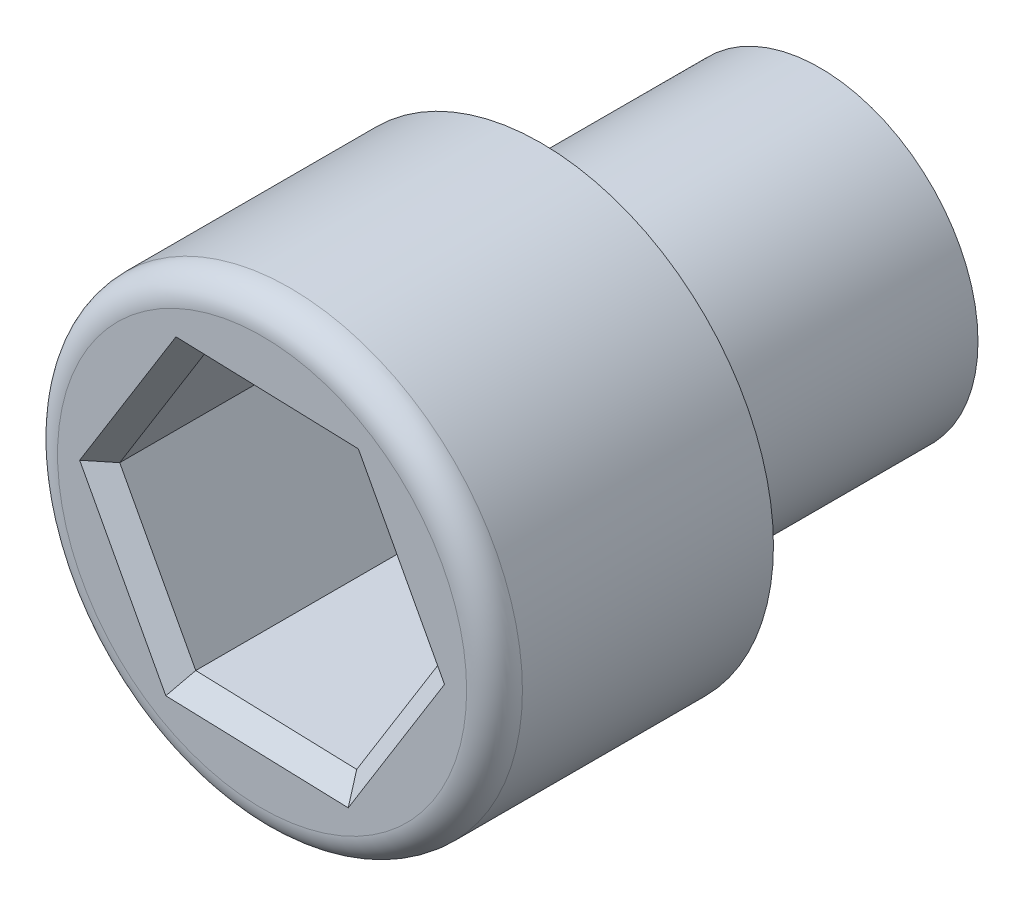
ISO-10303-21;
HEADER;
FILE_DESCRIPTION(('STEP AP214'),'2;1');
FILE_NAME('part.step','',(''),(''),'','','');
FILE_SCHEMA(('AUTOMOTIVE_DESIGN { 1 0 10303 214 1 1 1 1 }'));
ENDSEC;
DATA;
#1=APPLICATION_CONTEXT('core data for automotive mechanical design processes');
#2=APPLICATION_PROTOCOL_DEFINITION('international standard','automotive_design',2000,#1);
#3=PRODUCT_CONTEXT('',#1,'mechanical');
#4=PRODUCT('Part','Part','',(#3));
#5=PRODUCT_RELATED_PRODUCT_CATEGORY('part','',(#4));
#6=PRODUCT_DEFINITION_FORMATION('','',#4);
#7=PRODUCT_DEFINITION_CONTEXT('part definition',#1,'design');
#8=PRODUCT_DEFINITION('design','',#6,#7);
#9=PRODUCT_DEFINITION_SHAPE('','',#8);
#10=(LENGTH_UNIT() NAMED_UNIT(*) SI_UNIT(.MILLI.,.METRE.));
#11=(NAMED_UNIT(*) PLANE_ANGLE_UNIT() SI_UNIT($,.RADIAN.));
#12=(NAMED_UNIT(*) SI_UNIT($,.STERADIAN.) SOLID_ANGLE_UNIT());
#13=UNCERTAINTY_MEASURE_WITH_UNIT(LENGTH_MEASURE(1.E-05),#10,'distance_accuracy_value','');
#14=(GEOMETRIC_REPRESENTATION_CONTEXT(3) GLOBAL_UNCERTAINTY_ASSIGNED_CONTEXT((#13)) GLOBAL_UNIT_ASSIGNED_CONTEXT((#10,
#11,#12)) REPRESENTATION_CONTEXT('',''));
#15=CARTESIAN_POINT('',(0.,0.,0.));
#16=DIRECTION('',(0.,0.,1.));
#17=DIRECTION('',(1.,0.,0.));
#18=AXIS2_PLACEMENT_3D('',#15,#16,#17);
#19=CARTESIAN_POINT('',(0.,0.,3.));
#20=DIRECTION('',(0.,0.,-1.));
#21=DIRECTION('',(-1.,0.,0.));
#22=AXIS2_PLACEMENT_3D('',#19,#20,#21);
#23=CYLINDRICAL_SURFACE('',#22,1.7);
#24=CARTESIAN_POINT('',(0.,0.,3.));
#25=DIRECTION('',(0.,0.,1.));
#26=DIRECTION('',(1.,0.,0.));
#27=AXIS2_PLACEMENT_3D('',#24,#25,#26);
#28=CIRCLE('',#27,1.7);
#29=CARTESIAN_POINT('',(1.69999798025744,0.00262051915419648,3.));
#30=VERTEX_POINT('',#29);
#31=CARTESIAN_POINT('',(0.944881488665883,1.41322290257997,3.));
#32=VERTEX_POINT('',#31);
#33=EDGE_CURVE('E265',#30,#32,#28,.T.);
#34=ORIENTED_EDGE('',*,*,#33,.F.);
#35=CARTESIAN_POINT('',(1.69632767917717,-0.111679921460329,3.));
#36=VERTEX_POINT('',#35);
#37=EDGE_CURVE('E270',#36,#30,#28,.T.);
#38=ORIENTED_EDGE('',*,*,#37,.F.);
#39=CARTESIAN_POINT('',(0.852268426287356,-1.47093117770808,3.));
#40=VERTEX_POINT('',#39);
#41=EDGE_CURVE('E364',#40,#36,#28,.T.);
#42=ORIENTED_EDGE('',*,*,#41,.F.);
#43=CARTESIAN_POINT('',(0.75144619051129,-1.5249028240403,3.));
#44=VERTEX_POINT('',#43);
#45=EDGE_CURVE('E362',#44,#40,#28,.T.);
#46=ORIENTED_EDGE('',*,*,#45,.F.);
#47=CARTESIAN_POINT('',(-0.84772955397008,-1.47355169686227,3.));
#48=VERTEX_POINT('',#47);
#49=EDGE_CURVE('E355',#48,#44,#28,.T.);
#50=ORIENTED_EDGE('',*,*,#49,.F.);
#51=CARTESIAN_POINT('',(-0.944881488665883,-1.41322290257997,3.));
#52=VERTEX_POINT('',#51);
#53=EDGE_CURVE('E360',#52,#48,#28,.T.);
#54=ORIENTED_EDGE('',*,*,#53,.F.);
#55=CARTESIAN_POINT('',(-1.69999798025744,-0.00262051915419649,3.));
#56=VERTEX_POINT('',#55);
#57=EDGE_CURVE('E363',#56,#52,#28,.T.);
#58=ORIENTED_EDGE('',*,*,#57,.F.);
#59=CARTESIAN_POINT('',(-1.69632767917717,0.111679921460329,3.));
#60=VERTEX_POINT('',#59);
#61=EDGE_CURVE('E375',#60,#56,#28,.T.);
#62=ORIENTED_EDGE('',*,*,#61,.F.);
#63=CARTESIAN_POINT('',(-0.852268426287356,1.47093117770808,3.));
#64=VERTEX_POINT('',#63);
#65=EDGE_CURVE('E374',#64,#60,#28,.T.);
#66=ORIENTED_EDGE('',*,*,#65,.F.);
#67=CARTESIAN_POINT('',(-0.75144619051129,1.5249028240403,3.));
#68=VERTEX_POINT('',#67);
#69=EDGE_CURVE('E373',#68,#64,#28,.T.);
#70=ORIENTED_EDGE('',*,*,#69,.F.);
#71=CARTESIAN_POINT('',(0.84772955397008,1.47355169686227,3.));
#72=VERTEX_POINT('',#71);
#73=EDGE_CURVE('E172',#72,#68,#28,.T.);
#74=ORIENTED_EDGE('',*,*,#73,.F.);
#75=EDGE_CURVE('E269',#32,#72,#28,.T.);
#76=ORIENTED_EDGE('',*,*,#75,.F.);
#77=EDGE_LOOP('',(#34,#38,#42,#46,#50,#54,#58,#62,#66,#70,#74,#76));
#78=FACE_BOUND('',#77,.T.);
#79=CARTESIAN_POINT('',(0.,0.,0.));
#80=DIRECTION('',(0.,0.,1.));
#81=DIRECTION('',(1.,0.,0.));
#82=AXIS2_PLACEMENT_3D('',#79,#80,#81);
#83=CIRCLE('',#82,1.7);
#84=CARTESIAN_POINT('',(1.7,0.,0.));
#85=VERTEX_POINT('',#84);
#86=EDGE_CURVE('E264',#85,#85,#83,.T.);
#87=ORIENTED_EDGE('',*,*,#86,.T.);
#88=EDGE_LOOP('',(#87));
#89=FACE_BOUND('',#88,.T.);
#90=ADVANCED_FACE('F33',(#78,#89),#23,.T.);
#91=CARTESIAN_POINT('',(0.,0.,0.));
#92=DIRECTION('',(0.,0.,1.));
#93=DIRECTION('',(1.,0.,0.));
#94=AXIS2_PLACEMENT_3D('',#91,#92,#93);
#95=PLANE('',#94);
#96=ORIENTED_EDGE('',*,*,#86,.F.);
#97=EDGE_LOOP('',(#96));
#98=FACE_BOUND('',#97,.T.);
#99=ADVANCED_FACE('F297',(#98),#95,.F.);
#100=CARTESIAN_POINT('',(0.,0.,6.));
#101=DIRECTION('',(0.,0.,-1.));
#102=DIRECTION('',(-1.,0.,0.));
#103=AXIS2_PLACEMENT_3D('',#100,#101,#102);
#104=CYLINDRICAL_SURFACE('',#103,2.5);
#105=CARTESIAN_POINT('',(0.,0.,5.7));
#106=DIRECTION('',(0.,0.,1.));
#107=DIRECTION('',(1.,0.,0.));
#108=AXIS2_PLACEMENT_3D('',#105,#106,#107);
#109=CIRCLE('',#108,2.5);
#110=CARTESIAN_POINT('',(2.5,0.,5.7));
#111=VERTEX_POINT('',#110);
#112=EDGE_CURVE('E180',#111,#111,#109,.F.);
#113=ORIENTED_EDGE('',*,*,#112,.T.);
#114=EDGE_LOOP('',(#113));
#115=FACE_BOUND('',#114,.T.);
#116=CARTESIAN_POINT('',(0.,0.,3.));
#117=DIRECTION('',(0.,0.,1.));
#118=DIRECTION('',(1.,0.,0.));
#119=AXIS2_PLACEMENT_3D('',#116,#117,#118);
#120=CIRCLE('',#119,2.5);
#121=CARTESIAN_POINT('',(2.5,0.,3.));
#122=VERTEX_POINT('',#121);
#123=EDGE_CURVE('E252',#122,#122,#120,.T.);
#124=ORIENTED_EDGE('',*,*,#123,.T.);
#125=EDGE_LOOP('',(#124));
#126=FACE_BOUND('',#125,.T.);
#127=ADVANCED_FACE('F278',(#115,#126),#104,.T.);
#128=CARTESIAN_POINT('',(0.,0.,6.));
#129=DIRECTION('',(0.,0.,1.));
#130=DIRECTION('',(1.,0.,0.));
#131=AXIS2_PLACEMENT_3D('',#128,#129,#130);
#132=PLANE('',#131);
#133=DIRECTION('',(-0.527537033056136,-0.849532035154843,0.));
#134=VECTOR('',#133,1.);
#135=CARTESIAN_POINT('',(0.987343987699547,-1.63252927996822,6.));
#136=LINE('',#135,#134);
#137=CARTESIAN_POINT('',(1.96197966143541,-0.0630011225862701,6.));
#138=VERTEX_POINT('',#137);
#139=CARTESIAN_POINT('',(0.926429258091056,-1.73062478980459,6.));
#140=VERTEX_POINT('',#139);
#141=EDGE_CURVE('E193',#138,#140,#136,.T.);
#142=ORIENTED_EDGE('',*,*,#141,.T.);
#143=DIRECTION('',(-0.999484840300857,0.0320944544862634,0.));
#144=VECTOR('',#143,1.);
#145=CARTESIAN_POINT('',(-0.920139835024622,-1.67132961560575,6.));
#146=LINE('',#145,#144);
#147=CARTESIAN_POINT('',(-1.03555040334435,-1.66762366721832,6.));
#148=VERTEX_POINT('',#147);
#149=EDGE_CURVE('E203',#140,#148,#146,.T.);
#150=ORIENTED_EDGE('',*,*,#149,.T.);
#151=DIRECTION('',(-0.471947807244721,0.881626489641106,0.));
#152=VECTOR('',#151,1.);
#153=CARTESIAN_POINT('',(-1.90748382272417,-0.0388003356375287,6.));
#154=LINE('',#153,#152);
#155=CARTESIAN_POINT('',(-1.96197966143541,0.0630011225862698,6.));
#156=VERTEX_POINT('',#155);
#157=EDGE_CURVE('E201',#148,#156,#154,.T.);
#158=ORIENTED_EDGE('',*,*,#157,.T.);
#159=DIRECTION('',(0.527537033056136,0.849532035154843,0.));
#160=VECTOR('',#159,1.);
#161=CARTESIAN_POINT('',(-0.987343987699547,1.63252927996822,6.));
#162=LINE('',#161,#160);
#163=CARTESIAN_POINT('',(-0.926429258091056,1.73062478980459,6.));
#164=VERTEX_POINT('',#163);
#165=EDGE_CURVE('E199',#156,#164,#162,.T.);
#166=ORIENTED_EDGE('',*,*,#165,.T.);
#167=DIRECTION('',(0.999484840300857,-0.0320944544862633,0.));
#168=VECTOR('',#167,1.);
#169=CARTESIAN_POINT('',(0.920139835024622,1.67132961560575,6.));
#170=LINE('',#169,#168);
#171=CARTESIAN_POINT('',(1.03555040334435,1.66762366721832,6.));
#172=VERTEX_POINT('',#171);
#173=EDGE_CURVE('E197',#164,#172,#170,.T.);
#174=ORIENTED_EDGE('',*,*,#173,.T.);
#175=DIRECTION('',(0.471947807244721,-0.881626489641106,0.));
#176=VECTOR('',#175,1.);
#177=CARTESIAN_POINT('',(1.90748382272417,0.0388003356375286,6.));
#178=LINE('',#177,#176);
#179=EDGE_CURVE('E195',#172,#138,#178,.T.);
#180=ORIENTED_EDGE('',*,*,#179,.T.);
#181=EDGE_LOOP('',(#142,#150,#158,#166,#174,#180));
#182=FACE_BOUND('',#181,.T.);
#183=CARTESIAN_POINT('',(0.,0.,6.));
#184=DIRECTION('',(0.,0.,1.));
#185=DIRECTION('',(1.,0.,0.));
#186=AXIS2_PLACEMENT_3D('',#183,#184,#185);
#187=CIRCLE('',#186,2.2);
#188=CARTESIAN_POINT('',(2.2,0.,6.));
#189=VERTEX_POINT('',#188);
#190=EDGE_CURVE('E268',#189,#189,#187,.T.);
#191=ORIENTED_EDGE('',*,*,#190,.T.);
#192=EDGE_LOOP('',(#191));
#193=FACE_BOUND('',#192,.T.);
#194=ADVANCED_FACE('F288',(#182,#193),#132,.T.);
#195=CARTESIAN_POINT('',(0.,0.,3.));
#196=DIRECTION('',(0.,0.,1.));
#197=DIRECTION('',(1.,0.,0.));
#198=AXIS2_PLACEMENT_3D('',#195,#196,#197);
#199=PLANE('',#198);
#200=DIRECTION('',(-0.471947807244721,0.881626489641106,0.));
#201=VECTOR('',#200,1.);
#202=CARTESIAN_POINT('',(1.32243973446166,0.707921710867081,3.));
#203=LINE('',#202,#201);
#204=CARTESIAN_POINT('',(0.91372094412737,1.47143264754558,3.));
#205=VERTEX_POINT('',#204);
#206=EDGE_CURVE('E188',#32,#205,#203,.T.);
#207=ORIENTED_EDGE('',*,*,#206,.T.);
#208=DIRECTION('',(-0.999484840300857,0.0320944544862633,0.));
#209=VECTOR('',#208,1.);
#210=CARTESIAN_POINT('',(0.91372094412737,1.47143264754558,3.));
#211=LINE('',#210,#209);
#212=EDGE_CURVE('E231',#205,#72,#211,.T.);
#213=ORIENTED_EDGE('',*,*,#212,.T.);
#214=ORIENTED_EDGE('',*,*,#73,.T.);
#215=DIRECTION('',(-0.999484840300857,0.0320944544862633,0.));
#216=VECTOR('',#215,1.);
#217=CARTESIAN_POINT('',(0.048141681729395,1.49922726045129,3.));
#218=LINE('',#217,#216);
#219=CARTESIAN_POINT('',(-0.81743758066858,1.52702187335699,3.));
#220=VERTEX_POINT('',#219);
#221=EDGE_CURVE('E146',#68,#220,#218,.T.);
#222=ORIENTED_EDGE('',*,*,#221,.T.);
#223=DIRECTION('',(-0.527537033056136,-0.849532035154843,0.));
#224=VECTOR('',#223,1.);
#225=CARTESIAN_POINT('',(-0.81743758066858,1.52702187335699,3.));
#226=LINE('',#225,#224);
#227=EDGE_CURVE('E156',#220,#64,#226,.T.);
#228=ORIENTED_EDGE('',*,*,#227,.T.);
#229=ORIENTED_EDGE('',*,*,#65,.T.);
#230=DIRECTION('',(-0.527537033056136,-0.849532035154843,0.));
#231=VECTOR('',#230,1.);
#232=CARTESIAN_POINT('',(-1.27429805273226,0.791305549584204,3.));
#233=LINE('',#232,#231);
#234=CARTESIAN_POINT('',(-1.73115852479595,0.0555892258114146,3.));
#235=VERTEX_POINT('',#234);
#236=EDGE_CURVE('E174',#60,#235,#233,.T.);
#237=ORIENTED_EDGE('',*,*,#236,.T.);
#238=DIRECTION('',(0.471947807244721,-0.881626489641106,0.));
#239=VECTOR('',#238,1.);
#240=CARTESIAN_POINT('',(-1.73115852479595,0.0555892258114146,3.));
#241=LINE('',#240,#239);
#242=EDGE_CURVE('E236',#235,#56,#241,.T.);
#243=ORIENTED_EDGE('',*,*,#242,.T.);
#244=ORIENTED_EDGE('',*,*,#57,.T.);
#245=DIRECTION('',(0.471947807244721,-0.881626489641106,0.));
#246=VECTOR('',#245,1.);
#247=CARTESIAN_POINT('',(-1.32243973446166,-0.707921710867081,3.));
#248=LINE('',#247,#246);
#249=CARTESIAN_POINT('',(-0.913720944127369,-1.47143264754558,3.));
#250=VERTEX_POINT('',#249);
#251=EDGE_CURVE('E173',#52,#250,#248,.T.);
#252=ORIENTED_EDGE('',*,*,#251,.T.);
#253=DIRECTION('',(0.999484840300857,-0.0320944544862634,0.));
#254=VECTOR('',#253,1.);
#255=CARTESIAN_POINT('',(-0.913720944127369,-1.47143264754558,3.));
#256=LINE('',#255,#254);
#257=EDGE_CURVE('E240',#250,#48,#256,.T.);
#258=ORIENTED_EDGE('',*,*,#257,.T.);
#259=ORIENTED_EDGE('',*,*,#49,.T.);
#260=DIRECTION('',(0.999484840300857,-0.0320944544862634,0.));
#261=VECTOR('',#260,1.);
#262=CARTESIAN_POINT('',(-0.0481416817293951,-1.49922726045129,3.));
#263=LINE('',#262,#261);
#264=CARTESIAN_POINT('',(0.81743758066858,-1.52702187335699,3.));
#265=VERTEX_POINT('',#264);
#266=EDGE_CURVE('E177',#44,#265,#263,.T.);
#267=ORIENTED_EDGE('',*,*,#266,.T.);
#268=DIRECTION('',(0.527537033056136,0.849532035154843,0.));
#269=VECTOR('',#268,1.);
#270=CARTESIAN_POINT('',(0.81743758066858,-1.52702187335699,3.));
#271=LINE('',#270,#269);
#272=EDGE_CURVE('E244',#265,#40,#271,.T.);
#273=ORIENTED_EDGE('',*,*,#272,.T.);
#274=ORIENTED_EDGE('',*,*,#41,.T.);
#275=DIRECTION('',(0.527537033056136,0.849532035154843,0.));
#276=VECTOR('',#275,1.);
#277=CARTESIAN_POINT('',(1.27429805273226,-0.791305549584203,3.));
#278=LINE('',#277,#276);
#279=CARTESIAN_POINT('',(1.73115852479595,-0.0555892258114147,3.));
#280=VERTEX_POINT('',#279);
#281=EDGE_CURVE('E185',#36,#280,#278,.T.);
#282=ORIENTED_EDGE('',*,*,#281,.T.);
#283=DIRECTION('',(-0.471947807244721,0.881626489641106,0.));
#284=VECTOR('',#283,1.);
#285=CARTESIAN_POINT('',(1.73115852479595,-0.0555892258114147,3.));
#286=LINE('',#285,#284);
#287=EDGE_CURVE('E153',#280,#30,#286,.T.);
#288=ORIENTED_EDGE('',*,*,#287,.T.);
#289=ORIENTED_EDGE('',*,*,#33,.T.);
#290=EDGE_LOOP('',(#207,#213,#214,#222,#228,#229,#237,#243,#244,#252,#258,#259,#267,#273,#274,
#282,#288,#289));
#291=FACE_BOUND('',#290,.T.);
#292=ORIENTED_EDGE('',*,*,#123,.F.);
#293=EDGE_LOOP('',(#292));
#294=FACE_BOUND('',#293,.T.);
#295=ADVANCED_FACE('F168',(#291,#294),#199,.F.);
#296=CARTESIAN_POINT('',(0.,0.,5.7));
#297=DIRECTION('',(0.,0.,1.));
#298=DIRECTION('',(1.,0.,0.));
#299=AXIS2_PLACEMENT_3D('',#296,#297,#298);
#300=TOROIDAL_SURFACE('',#299,2.2,0.3);
#301=ORIENTED_EDGE('',*,*,#112,.F.);
#302=EDGE_LOOP('',(#301));
#303=FACE_BOUND('',#302,.T.);
#304=ORIENTED_EDGE('',*,*,#190,.F.);
#305=EDGE_LOOP('',(#304));
#306=FACE_BOUND('',#305,.T.);
#307=ADVANCED_FACE('F281',(#303,#306),#300,.T.);
#308=CARTESIAN_POINT('',(0.,0.,3.));
#309=DIRECTION('',(0.,0.,1.));
#310=DIRECTION('',(1.,0.,0.));
#311=AXIS2_PLACEMENT_3D('',#308,#309,#310);
#312=PLANE('',#311);
#313=ORIENTED_EDGE('',*,*,#75,.T.);
#314=EDGE_CURVE('E227',#72,#68,#211,.T.);
#315=ORIENTED_EDGE('',*,*,#314,.T.);
#316=ORIENTED_EDGE('',*,*,#69,.T.);
#317=EDGE_CURVE('E159',#64,#60,#226,.T.);
#318=ORIENTED_EDGE('',*,*,#317,.T.);
#319=ORIENTED_EDGE('',*,*,#61,.T.);
#320=EDGE_CURVE('E164',#56,#52,#241,.T.);
#321=ORIENTED_EDGE('',*,*,#320,.T.);
#322=ORIENTED_EDGE('',*,*,#53,.T.);
#323=EDGE_CURVE('E239',#48,#44,#256,.T.);
#324=ORIENTED_EDGE('',*,*,#323,.T.);
#325=ORIENTED_EDGE('',*,*,#45,.T.);
#326=EDGE_CURVE('E243',#40,#36,#271,.T.);
#327=ORIENTED_EDGE('',*,*,#326,.T.);
#328=ORIENTED_EDGE('',*,*,#37,.T.);
#329=EDGE_CURVE('E247',#30,#32,#286,.T.);
#330=ORIENTED_EDGE('',*,*,#329,.T.);
#331=EDGE_LOOP('',(#313,#315,#316,#318,#319,#321,#322,#324,#325,#327,#328,#330));
#332=FACE_BOUND('',#331,.T.);
#333=ADVANCED_FACE('F284',(#332),#312,.T.);
#334=CARTESIAN_POINT('',(0.91372094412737,1.47143264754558,3.));
#335=DIRECTION('',(0.0320944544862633,0.999484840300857,0.));
#336=DIRECTION('',(-0.999484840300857,0.0320944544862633,0.));
#337=AXIS2_PLACEMENT_3D('',#334,#335,#336);
#338=PLANE('',#337);
#339=DIRECTION('',(0.,0.,1.));
#340=VECTOR('',#339,1.);
#341=CARTESIAN_POINT('',(0.91372094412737,1.47143264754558,3.));
#342=LINE('',#341,#340);
#343=CARTESIAN_POINT('',(0.91372094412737,1.47143264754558,5.8));
#344=VERTEX_POINT('',#343);
#345=EDGE_CURVE('E250',#205,#344,#342,.T.);
#346=ORIENTED_EDGE('',*,*,#345,.T.);
#347=DIRECTION('',(-0.999484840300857,0.0320944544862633,0.));
#348=VECTOR('',#347,1.);
#349=CARTESIAN_POINT('',(-0.81743758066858,1.52702187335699,5.8));
#350=LINE('',#349,#348);
#351=CARTESIAN_POINT('',(-0.81743758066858,1.52702187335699,5.8));
#352=VERTEX_POINT('',#351);
#353=EDGE_CURVE('E149',#344,#352,#350,.T.);
#354=ORIENTED_EDGE('',*,*,#353,.T.);
#355=DIRECTION('',(0.,0.,1.));
#356=VECTOR('',#355,1.);
#357=CARTESIAN_POINT('',(-0.81743758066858,1.52702187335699,3.));
#358=LINE('',#357,#356);
#359=EDGE_CURVE('E141',#220,#352,#358,.T.);
#360=ORIENTED_EDGE('',*,*,#359,.F.);
#361=ORIENTED_EDGE('',*,*,#221,.F.);
#362=ORIENTED_EDGE('',*,*,#314,.F.);
#363=ORIENTED_EDGE('',*,*,#212,.F.);
#364=EDGE_LOOP('',(#346,#354,#360,#361,#362,#363));
#365=FACE_BOUND('',#364,.T.);
#366=ADVANCED_FACE('F143',(#365),#338,.F.);
#367=CARTESIAN_POINT('',(1.73115852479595,-0.0555892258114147,3.));
#368=DIRECTION('',(0.881626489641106,0.471947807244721,0.));
#369=DIRECTION('',(-0.471947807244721,0.881626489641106,0.));
#370=AXIS2_PLACEMENT_3D('',#367,#368,#369);
#371=PLANE('',#370);
#372=DIRECTION('',(0.,0.,1.));
#373=VECTOR('',#372,1.);
#374=CARTESIAN_POINT('',(1.73115852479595,-0.0555892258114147,3.));
#375=LINE('',#374,#373);
#376=CARTESIAN_POINT('',(1.73115852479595,-0.0555892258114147,5.8));
#377=VERTEX_POINT('',#376);
#378=EDGE_CURVE('E253',#280,#377,#375,.T.);
#379=ORIENTED_EDGE('',*,*,#378,.T.);
#380=DIRECTION('',(-0.471947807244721,0.881626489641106,0.));
#381=VECTOR('',#380,1.);
#382=CARTESIAN_POINT('',(0.91372094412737,1.47143264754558,5.8));
#383=LINE('',#382,#381);
#384=EDGE_CURVE('E42',#377,#344,#383,.T.);
#385=ORIENTED_EDGE('',*,*,#384,.T.);
#386=ORIENTED_EDGE('',*,*,#345,.F.);
#387=ORIENTED_EDGE('',*,*,#206,.F.);
#388=ORIENTED_EDGE('',*,*,#329,.F.);
#389=ORIENTED_EDGE('',*,*,#287,.F.);
#390=EDGE_LOOP('',(#379,#385,#386,#387,#388,#389));
#391=FACE_BOUND('',#390,.T.);
#392=ADVANCED_FACE('F372',(#391),#371,.F.);
#393=CARTESIAN_POINT('',(0.81743758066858,-1.52702187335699,3.));
#394=DIRECTION('',(0.849532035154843,-0.527537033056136,0.));
#395=DIRECTION('',(0.527537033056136,0.849532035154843,0.));
#396=AXIS2_PLACEMENT_3D('',#393,#394,#395);
#397=PLANE('',#396);
#398=DIRECTION('',(0.,0.,1.));
#399=VECTOR('',#398,1.);
#400=CARTESIAN_POINT('',(0.81743758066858,-1.52702187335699,3.));
#401=LINE('',#400,#399);
#402=CARTESIAN_POINT('',(0.81743758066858,-1.52702187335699,5.8));
#403=VERTEX_POINT('',#402);
#404=EDGE_CURVE('E255',#265,#403,#401,.T.);
#405=ORIENTED_EDGE('',*,*,#404,.T.);
#406=DIRECTION('',(0.527537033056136,0.849532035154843,0.));
#407=VECTOR('',#406,1.);
#408=CARTESIAN_POINT('',(1.73115852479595,-0.0555892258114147,5.8));
#409=LINE('',#408,#407);
#410=EDGE_CURVE('E11',#403,#377,#409,.T.);
#411=ORIENTED_EDGE('',*,*,#410,.T.);
#412=ORIENTED_EDGE('',*,*,#378,.F.);
#413=ORIENTED_EDGE('',*,*,#281,.F.);
#414=ORIENTED_EDGE('',*,*,#326,.F.);
#415=ORIENTED_EDGE('',*,*,#272,.F.);
#416=EDGE_LOOP('',(#405,#411,#412,#413,#414,#415));
#417=FACE_BOUND('',#416,.T.);
#418=ADVANCED_FACE('F379',(#417),#397,.F.);
#419=CARTESIAN_POINT('',(-0.913720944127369,-1.47143264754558,3.));
#420=DIRECTION('',(-0.0320944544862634,-0.999484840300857,0.));
#421=DIRECTION('',(0.999484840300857,-0.0320944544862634,0.));
#422=AXIS2_PLACEMENT_3D('',#419,#420,#421);
#423=PLANE('',#422);
#424=DIRECTION('',(0.,0.,1.));
#425=VECTOR('',#424,1.);
#426=CARTESIAN_POINT('',(-0.913720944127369,-1.47143264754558,3.));
#427=LINE('',#426,#425);
#428=CARTESIAN_POINT('',(-0.913720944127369,-1.47143264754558,5.8));
#429=VERTEX_POINT('',#428);
#430=EDGE_CURVE('E257',#250,#429,#427,.T.);
#431=ORIENTED_EDGE('',*,*,#430,.T.);
#432=DIRECTION('',(0.999484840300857,-0.0320944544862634,0.));
#433=VECTOR('',#432,1.);
#434=CARTESIAN_POINT('',(0.81743758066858,-1.52702187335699,5.8));
#435=LINE('',#434,#433);
#436=EDGE_CURVE('E190',#429,#403,#435,.T.);
#437=ORIENTED_EDGE('',*,*,#436,.T.);
#438=ORIENTED_EDGE('',*,*,#404,.F.);
#439=ORIENTED_EDGE('',*,*,#266,.F.);
#440=ORIENTED_EDGE('',*,*,#323,.F.);
#441=ORIENTED_EDGE('',*,*,#257,.F.);
#442=EDGE_LOOP('',(#431,#437,#438,#439,#440,#441));
#443=FACE_BOUND('',#442,.T.);
#444=ADVANCED_FACE('F349',(#443),#423,.F.);
#445=CARTESIAN_POINT('',(-1.73115852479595,0.0555892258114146,3.));
#446=DIRECTION('',(-0.881626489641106,-0.471947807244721,0.));
#447=DIRECTION('',(0.471947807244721,-0.881626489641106,0.));
#448=AXIS2_PLACEMENT_3D('',#445,#446,#447);
#449=PLANE('',#448);
#450=DIRECTION('',(0.,0.,1.));
#451=VECTOR('',#450,1.);
#452=CARTESIAN_POINT('',(-1.73115852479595,0.0555892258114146,3.));
#453=LINE('',#452,#451);
#454=CARTESIAN_POINT('',(-1.73115852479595,0.0555892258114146,5.8));
#455=VERTEX_POINT('',#454);
#456=EDGE_CURVE('E152',#235,#455,#453,.T.);
#457=ORIENTED_EDGE('',*,*,#456,.T.);
#458=DIRECTION('',(0.471947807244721,-0.881626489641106,0.));
#459=VECTOR('',#458,1.);
#460=CARTESIAN_POINT('',(-0.913720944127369,-1.47143264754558,5.8));
#461=LINE('',#460,#459);
#462=EDGE_CURVE('E206',#455,#429,#461,.T.);
#463=ORIENTED_EDGE('',*,*,#462,.T.);
#464=ORIENTED_EDGE('',*,*,#430,.F.);
#465=ORIENTED_EDGE('',*,*,#251,.F.);
#466=ORIENTED_EDGE('',*,*,#320,.F.);
#467=ORIENTED_EDGE('',*,*,#242,.F.);
#468=EDGE_LOOP('',(#457,#463,#464,#465,#466,#467));
#469=FACE_BOUND('',#468,.T.);
#470=ADVANCED_FACE('F334',(#469),#449,.F.);
#471=CARTESIAN_POINT('',(-0.81743758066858,1.52702187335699,3.));
#472=DIRECTION('',(-0.849532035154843,0.527537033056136,0.));
#473=DIRECTION('',(-0.527537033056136,-0.849532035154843,0.));
#474=AXIS2_PLACEMENT_3D('',#471,#472,#473);
#475=PLANE('',#474);
#476=ORIENTED_EDGE('',*,*,#359,.T.);
#477=DIRECTION('',(-0.527537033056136,-0.849532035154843,0.));
#478=VECTOR('',#477,1.);
#479=CARTESIAN_POINT('',(-1.73115852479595,0.0555892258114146,5.8));
#480=LINE('',#479,#478);
#481=EDGE_CURVE('E208',#352,#455,#480,.T.);
#482=ORIENTED_EDGE('',*,*,#481,.T.);
#483=ORIENTED_EDGE('',*,*,#456,.F.);
#484=ORIENTED_EDGE('',*,*,#236,.F.);
#485=ORIENTED_EDGE('',*,*,#317,.F.);
#486=ORIENTED_EDGE('',*,*,#227,.F.);
#487=EDGE_LOOP('',(#476,#482,#483,#484,#485,#486));
#488=FACE_BOUND('',#487,.T.);
#489=ADVANCED_FACE('F157',(#488),#475,.F.);
#490=CARTESIAN_POINT('',(0.91372094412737,1.47143264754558,5.8));
#491=DIRECTION('',(-0.0226942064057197,-0.706742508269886,0.70710678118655));
#492=DIRECTION('',(0.999484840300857,-0.0320944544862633,0.));
#493=AXIS2_PLACEMENT_3D('',#490,#491,#492);
#494=PLANE('',#493);
#495=DIRECTION('',(-0.398780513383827,-0.642185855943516,-0.654653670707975));
#496=VECTOR('',#495,1.);
#497=CARTESIAN_POINT('',(0.913720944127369,1.47143264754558,5.8));
#498=LINE('',#497,#496);
#499=EDGE_CURVE('E221',#172,#344,#498,.T.);
#500=ORIENTED_EDGE('',*,*,#499,.F.);
#501=ORIENTED_EDGE('',*,*,#173,.F.);
#502=DIRECTION('',(0.356759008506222,-0.666446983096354,-0.654653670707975));
#503=VECTOR('',#502,1.);
#504=CARTESIAN_POINT('',(-0.81743758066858,1.52702187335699,5.8));
#505=LINE('',#504,#503);
#506=EDGE_CURVE('E37',#352,#164,#505,.F.);
#507=ORIENTED_EDGE('',*,*,#506,.F.);
#508=ORIENTED_EDGE('',*,*,#353,.F.);
#509=EDGE_LOOP('',(#500,#501,#507,#508));
#510=FACE_BOUND('',#509,.T.);
#511=ADVANCED_FACE('F35',(#510),#494,.T.);
#512=CARTESIAN_POINT('',(-0.81743758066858,1.52702187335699,5.8));
#513=DIRECTION('',(0.600709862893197,-0.373025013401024,0.707106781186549));
#514=DIRECTION('',(0.527537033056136,0.849532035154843,0.));
#515=AXIS2_PLACEMENT_3D('',#512,#513,#514);
#516=PLANE('',#515);
#517=ORIENTED_EDGE('',*,*,#506,.T.);
#518=ORIENTED_EDGE('',*,*,#165,.F.);
#519=DIRECTION('',(0.755539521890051,-0.0242611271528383,-0.654653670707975));
#520=VECTOR('',#519,1.);
#521=CARTESIAN_POINT('',(-1.73115852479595,0.0555892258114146,5.8));
#522=LINE('',#521,#520);
#523=EDGE_CURVE('E219',#455,#156,#522,.F.);
#524=ORIENTED_EDGE('',*,*,#523,.F.);
#525=ORIENTED_EDGE('',*,*,#481,.F.);
#526=EDGE_LOOP('',(#517,#518,#524,#525));
#527=FACE_BOUND('',#526,.T.);
#528=ADVANCED_FACE('F325',(#527),#516,.T.);
#529=CARTESIAN_POINT('',(1.73115852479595,-0.0555892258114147,5.8));
#530=DIRECTION('',(-0.623404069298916,-0.333717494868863,0.707106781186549));
#531=DIRECTION('',(0.471947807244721,-0.881626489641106,0.));
#532=AXIS2_PLACEMENT_3D('',#529,#530,#531);
#533=PLANE('',#532);
#534=ORIENTED_EDGE('',*,*,#499,.T.);
#535=ORIENTED_EDGE('',*,*,#384,.F.);
#536=DIRECTION('',(-0.755539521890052,0.0242611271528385,-0.654653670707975));
#537=VECTOR('',#536,1.);
#538=CARTESIAN_POINT('',(1.73115852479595,-0.0555892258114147,5.8));
#539=LINE('',#538,#537);
#540=EDGE_CURVE('E216',#138,#377,#539,.T.);
#541=ORIENTED_EDGE('',*,*,#540,.F.);
#542=ORIENTED_EDGE('',*,*,#179,.F.);
#543=EDGE_LOOP('',(#534,#535,#541,#542));
#544=FACE_BOUND('',#543,.T.);
#545=ADVANCED_FACE('F322',(#544),#533,.T.);
#546=CARTESIAN_POINT('',(-1.73115852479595,0.0555892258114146,5.8));
#547=DIRECTION('',(0.623404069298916,0.333717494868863,0.707106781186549));
#548=DIRECTION('',(-0.471947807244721,0.881626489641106,0.));
#549=AXIS2_PLACEMENT_3D('',#546,#547,#548);
#550=PLANE('',#549);
#551=ORIENTED_EDGE('',*,*,#523,.T.);
#552=ORIENTED_EDGE('',*,*,#157,.F.);
#553=DIRECTION('',(0.398780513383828,0.642185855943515,-0.654653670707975));
#554=VECTOR('',#553,1.);
#555=CARTESIAN_POINT('',(-0.913720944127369,-1.47143264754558,5.8));
#556=LINE('',#555,#554);
#557=EDGE_CURVE('E214',#429,#148,#556,.F.);
#558=ORIENTED_EDGE('',*,*,#557,.F.);
#559=ORIENTED_EDGE('',*,*,#462,.F.);
#560=EDGE_LOOP('',(#551,#552,#558,#559));
#561=FACE_BOUND('',#560,.T.);
#562=ADVANCED_FACE('F318',(#561),#550,.T.);
#563=CARTESIAN_POINT('',(0.81743758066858,-1.52702187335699,5.8));
#564=DIRECTION('',(-0.600709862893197,0.373025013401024,0.707106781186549));
#565=DIRECTION('',(-0.527537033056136,-0.849532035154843,0.));
#566=AXIS2_PLACEMENT_3D('',#563,#564,#565);
#567=PLANE('',#566);
#568=ORIENTED_EDGE('',*,*,#540,.T.);
#569=ORIENTED_EDGE('',*,*,#410,.F.);
#570=DIRECTION('',(0.356759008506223,-0.666446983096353,0.654653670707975));
#571=VECTOR('',#570,1.);
#572=CARTESIAN_POINT('',(0.583883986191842,-1.09072990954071,5.37142857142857));
#573=LINE('',#572,#571);
#574=EDGE_CURVE('E212',#140,#403,#573,.F.);
#575=ORIENTED_EDGE('',*,*,#574,.F.);
#576=ORIENTED_EDGE('',*,*,#141,.F.);
#577=EDGE_LOOP('',(#568,#569,#575,#576));
#578=FACE_BOUND('',#577,.T.);
#579=ADVANCED_FACE('F314',(#578),#567,.T.);
#580=CARTESIAN_POINT('',(-0.913720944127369,-1.47143264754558,5.8));
#581=DIRECTION('',(0.0226942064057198,0.706742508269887,0.707106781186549));
#582=DIRECTION('',(-0.999484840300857,0.0320944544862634,0.));
#583=AXIS2_PLACEMENT_3D('',#580,#581,#582);
#584=PLANE('',#583);
#585=ORIENTED_EDGE('',*,*,#557,.T.);
#586=ORIENTED_EDGE('',*,*,#149,.F.);
#587=ORIENTED_EDGE('',*,*,#574,.T.);
#588=ORIENTED_EDGE('',*,*,#436,.F.);
#589=EDGE_LOOP('',(#585,#586,#587,#588));
#590=FACE_BOUND('',#589,.T.);
#591=ADVANCED_FACE('F311',(#590),#584,.T.);
#592=CLOSED_SHELL('',(#90,#99,#127,#194,#295,#307,#333,#366,#392,#418,#444,#470,#489,#511,#528,
#545,#562,#579,#591));
#593=MANIFOLD_SOLID_BREP('B2',#592);
#594=ADVANCED_BREP_SHAPE_REPRESENTATION('',(#18,#593),#14);
#595=SHAPE_DEFINITION_REPRESENTATION(#9,#594);
ENDSEC;
END-ISO-10303-21;
